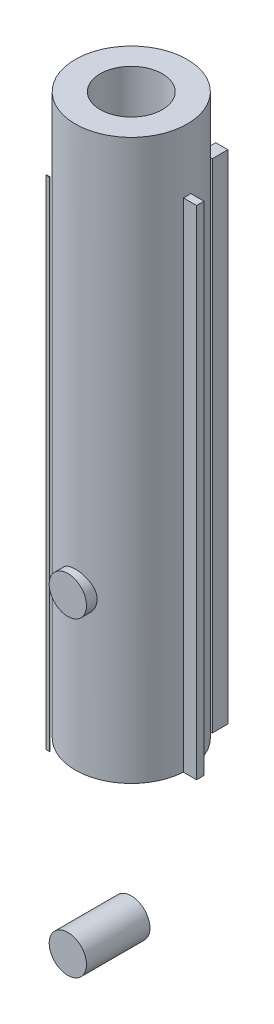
from build123d import *

# Parameters (mm, degrees)
SKETCH1_R           = 9000
SKETCH1_R_2         = 5000
BOSS_EXTRUDE1_DEPTH = 90000
SKETCH2_W           = 2700
SKETCH2_H           = 1200
SKETCH2_W_2         = 1950
SKETCH2_H_2         = 2499.038105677
SKETCH2_W_3         = 554.933921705
SKETCH2_H_3         = 2351.014846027
SKETCH2_W_4         = 300
SKETCH2_H_4         = 99.038105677
BOSS_EXTRUDE2_DEPTH = 80000
SKETCH3_R           = 3000
BOSS_EXTRUDE3_DEPTH = 10200


with BuildPart() as part:
    # Sketch1 → Boss-Extrude1 (new body)
    with BuildSketch(Plane(origin=(0, 0, 0), x_dir=(1, 0, 0), z_dir=(0, 1, 0))):
        with Locations(Location((0, 0, 0), (0, 0, 270))):
            Circle(SKETCH1_R)
        with Locations(Location((0, 0, 0), (0, 0, 270))):
            Circle(SKETCH1_R_2, mode=Mode.SUBTRACT)
    extrude(amount=BOSS_EXTRUDE1_DEPTH)

    # Sketch2 → Boss-Extrude2 (add)
    with BuildSketch(Plane(origin=(0, 0, 0), x_dir=(1, 0, 0), z_dir=(0, 1, 0))):
        with Locations((9750, 0)):
            Rectangle(SKETCH2_W, SKETCH2_H)
        with Locations((4875, 8443.747686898)):
            Rectangle(SKETCH2_W_2, SKETCH2_H_2)
        with Locations((-4927.466960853, 8517.759316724)):
            Rectangle(SKETCH2_W_3, SKETCH2_H_3)
        with Locations((-9750, 0)):
            Rectangle(SKETCH2_W_4, SKETCH2_H)
        with Locations((-4927.466960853, -8443.747686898)):
            Rectangle(SKETCH2_W_3, SKETCH2_H_4)
    extrude(amount=BOSS_EXTRUDE2_DEPTH)


with BuildPart() as boss_extrude2_piece_1:
    # of the separate pieces the step leaves, piece 1, a body of its own (boss_extrude2_pieces)
    add(part.part.solids().sort_by_distance((0, 0, 9000))[0])

    # Sketch3 → Boss-Extrude3 (add)
    with BuildSketch(Plane.XY):
        with Locations(Location((0, 25000, 0), (0, 0, 180))):
            Circle(SKETCH3_R)
        with Locations((0, -25000)):
            Circle(SKETCH3_R)
    extrude(amount=BOSS_EXTRUDE3_DEPTH)


with BuildPart() as boss_extrude2_piece_2:
    # of the separate pieces the step leaves, piece 2, a body of its own (boss_extrude2_pieces)
    add(part.part.solids().sort_by_distance((-9600, 0, 600))[0])


with BuildPart() as boss_extrude2_piece_3:
    # of the separate pieces the step leaves, piece 3, a body of its own (boss_extrude2_pieces)
    add(part.part.solids().sort_by_distance((-5204.933921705, 0, 8394.22863406))[0])


with BuildPart() as boss_extrude3_piece_1:
    # of the separate pieces the step leaves, piece 1, a body of its own (boss_extrude3_pieces)
    add(boss_extrude2_piece_1.part.solids().sort_by_distance((0, 0, 9000))[0])


with BuildPart() as boss_extrude3_piece_2:
    # of the separate pieces the step leaves, piece 2, a body of its own (boss_extrude3_pieces)
    add(boss_extrude2_piece_1.part.solids().sort_by_distance((3000, -25000, 0))[0])


solid = Compound([boss_extrude2_piece_2.part, boss_extrude2_piece_3.part, boss_extrude3_piece_1.part, boss_extrude3_piece_2.part])
